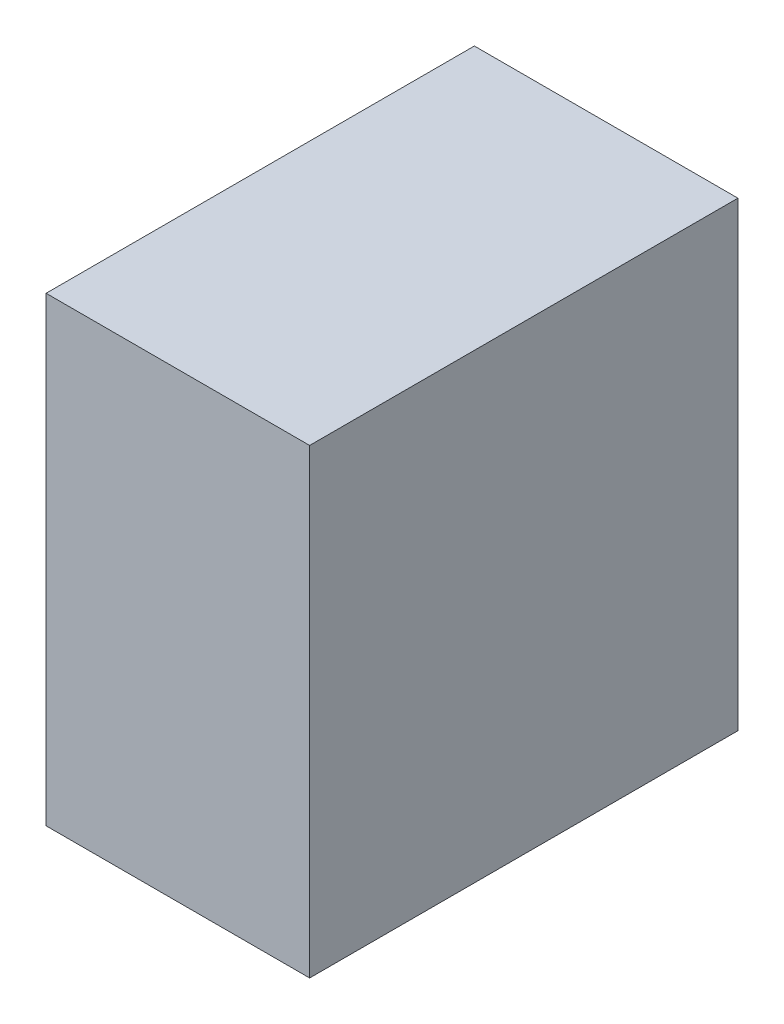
ISO-10303-21;
HEADER;
FILE_DESCRIPTION(('STEP AP214'),'2;1');
FILE_NAME('part.step','',(''),(''),'','','');
FILE_SCHEMA(('AUTOMOTIVE_DESIGN { 1 0 10303 214 1 1 1 1 }'));
ENDSEC;
DATA;
#1=APPLICATION_CONTEXT('core data for automotive mechanical design processes');
#2=APPLICATION_PROTOCOL_DEFINITION('international standard','automotive_design',2000,#1);
#3=PRODUCT_CONTEXT('',#1,'mechanical');
#4=PRODUCT('Part','Part','',(#3));
#5=PRODUCT_RELATED_PRODUCT_CATEGORY('part','',(#4));
#6=PRODUCT_DEFINITION_FORMATION('','',#4);
#7=PRODUCT_DEFINITION_CONTEXT('part definition',#1,'design');
#8=PRODUCT_DEFINITION('design','',#6,#7);
#9=PRODUCT_DEFINITION_SHAPE('','',#8);
#10=(LENGTH_UNIT() NAMED_UNIT(*) SI_UNIT(.MILLI.,.METRE.));
#11=(NAMED_UNIT(*) PLANE_ANGLE_UNIT() SI_UNIT($,.RADIAN.));
#12=(NAMED_UNIT(*) SI_UNIT($,.STERADIAN.) SOLID_ANGLE_UNIT());
#13=UNCERTAINTY_MEASURE_WITH_UNIT(LENGTH_MEASURE(1.E-05),#10,'distance_accuracy_value','');
#14=(GEOMETRIC_REPRESENTATION_CONTEXT(3) GLOBAL_UNCERTAINTY_ASSIGNED_CONTEXT((#13)) GLOBAL_UNIT_ASSIGNED_CONTEXT((#10,
#11,#12)) REPRESENTATION_CONTEXT('',''));
#15=CARTESIAN_POINT('',(0.,0.,0.));
#16=DIRECTION('',(0.,0.,1.));
#17=DIRECTION('',(1.,0.,0.));
#18=AXIS2_PLACEMENT_3D('',#15,#16,#17);
#19=CARTESIAN_POINT('',(-38.4705249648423,26.297870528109,13.));
#20=DIRECTION('',(1.,0.,0.));
#21=DIRECTION('',(0.,1.,0.));
#22=AXIS2_PLACEMENT_3D('',#19,#20,#21);
#23=PLANE('',#22);
#24=DIRECTION('',(0.,-1.,0.));
#25=VECTOR('',#24,1.);
#26=CARTESIAN_POINT('',(-38.4705249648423,26.297870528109,0.));
#27=LINE('',#26,#25);
#28=CARTESIAN_POINT('',(-38.4705249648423,26.297870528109,0.));
#29=VERTEX_POINT('',#28);
#30=CARTESIAN_POINT('',(-38.4705249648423,12.297870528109,0.));
#31=VERTEX_POINT('',#30);
#32=EDGE_CURVE('E96',#29,#31,#27,.T.);
#33=ORIENTED_EDGE('',*,*,#32,.T.);
#34=DIRECTION('',(0.,0.,-1.));
#35=VECTOR('',#34,1.);
#36=CARTESIAN_POINT('',(-38.4705249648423,12.297870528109,13.));
#37=LINE('',#36,#35);
#38=CARTESIAN_POINT('',(-38.4705249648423,12.297870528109,13.));
#39=VERTEX_POINT('',#38);
#40=EDGE_CURVE('E11',#39,#31,#37,.T.);
#41=ORIENTED_EDGE('',*,*,#40,.F.);
#42=DIRECTION('',(0.,-1.,0.));
#43=VECTOR('',#42,1.);
#44=CARTESIAN_POINT('',(-38.4705249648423,26.297870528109,13.));
#45=LINE('',#44,#43);
#46=CARTESIAN_POINT('',(-38.4705249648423,26.297870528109,13.));
#47=VERTEX_POINT('',#46);
#48=EDGE_CURVE('E84',#47,#39,#45,.T.);
#49=ORIENTED_EDGE('',*,*,#48,.F.);
#50=DIRECTION('',(0.,0.,-1.));
#51=VECTOR('',#50,1.);
#52=CARTESIAN_POINT('',(-38.4705249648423,26.297870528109,13.));
#53=LINE('',#52,#51);
#54=EDGE_CURVE('E92',#47,#29,#53,.T.);
#55=ORIENTED_EDGE('',*,*,#54,.T.);
#56=EDGE_LOOP('',(#33,#41,#49,#55));
#57=FACE_BOUND('',#56,.T.);
#58=ADVANCED_FACE('F33',(#57),#23,.F.);
#59=CARTESIAN_POINT('',(-38.4705249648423,12.297870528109,13.));
#60=DIRECTION('',(0.,1.,0.));
#61=DIRECTION('',(0.,0.,1.));
#62=AXIS2_PLACEMENT_3D('',#59,#60,#61);
#63=PLANE('',#62);
#64=DIRECTION('',(1.,0.,0.));
#65=VECTOR('',#64,1.);
#66=CARTESIAN_POINT('',(-38.4705249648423,12.297870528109,0.));
#67=LINE('',#66,#65);
#68=CARTESIAN_POINT('',(-30.4705249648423,12.297870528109,0.));
#69=VERTEX_POINT('',#68);
#70=EDGE_CURVE('E88',#31,#69,#67,.T.);
#71=ORIENTED_EDGE('',*,*,#70,.T.);
#72=DIRECTION('',(0.,0.,-1.));
#73=VECTOR('',#72,1.);
#74=CARTESIAN_POINT('',(-30.4705249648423,12.297870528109,13.));
#75=LINE('',#74,#73);
#76=CARTESIAN_POINT('',(-30.4705249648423,12.297870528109,13.));
#77=VERTEX_POINT('',#76);
#78=EDGE_CURVE('E41',#77,#69,#75,.T.);
#79=ORIENTED_EDGE('',*,*,#78,.F.);
#80=DIRECTION('',(1.,0.,0.));
#81=VECTOR('',#80,1.);
#82=CARTESIAN_POINT('',(-38.4705249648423,12.297870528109,13.));
#83=LINE('',#82,#81);
#84=EDGE_CURVE('E79',#39,#77,#83,.T.);
#85=ORIENTED_EDGE('',*,*,#84,.F.);
#86=ORIENTED_EDGE('',*,*,#40,.T.);
#87=EDGE_LOOP('',(#71,#79,#85,#86));
#88=FACE_BOUND('',#87,.T.);
#89=ADVANCED_FACE('F87',(#88),#63,.F.);
#90=CARTESIAN_POINT('',(-30.4705249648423,26.297870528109,13.));
#91=DIRECTION('',(-1.,0.,0.));
#92=DIRECTION('',(0.,-1.,0.));
#93=AXIS2_PLACEMENT_3D('',#90,#91,#92);
#94=PLANE('',#93);
#95=DIRECTION('',(0.,1.,0.));
#96=VECTOR('',#95,1.);
#97=CARTESIAN_POINT('',(-30.4705249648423,26.297870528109,0.));
#98=LINE('',#97,#96);
#99=CARTESIAN_POINT('',(-30.4705249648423,26.297870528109,0.));
#100=VERTEX_POINT('',#99);
#101=EDGE_CURVE('E66',#69,#100,#98,.T.);
#102=ORIENTED_EDGE('',*,*,#101,.T.);
#103=DIRECTION('',(0.,0.,-1.));
#104=VECTOR('',#103,1.);
#105=CARTESIAN_POINT('',(-30.4705249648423,26.297870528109,13.));
#106=LINE('',#105,#104);
#107=CARTESIAN_POINT('',(-30.4705249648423,26.297870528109,13.));
#108=VERTEX_POINT('',#107);
#109=EDGE_CURVE('E89',#108,#100,#106,.T.);
#110=ORIENTED_EDGE('',*,*,#109,.F.);
#111=DIRECTION('',(0.,1.,0.));
#112=VECTOR('',#111,1.);
#113=CARTESIAN_POINT('',(-30.4705249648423,26.297870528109,13.));
#114=LINE('',#113,#112);
#115=EDGE_CURVE('E82',#77,#108,#114,.T.);
#116=ORIENTED_EDGE('',*,*,#115,.F.);
#117=ORIENTED_EDGE('',*,*,#78,.T.);
#118=EDGE_LOOP('',(#102,#110,#116,#117));
#119=FACE_BOUND('',#118,.T.);
#120=ADVANCED_FACE('F90',(#119),#94,.F.);
#121=CARTESIAN_POINT('',(-38.4705249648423,26.297870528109,13.));
#122=DIRECTION('',(0.,-1.,0.));
#123=DIRECTION('',(0.,0.,-1.));
#124=AXIS2_PLACEMENT_3D('',#121,#122,#123);
#125=PLANE('',#124);
#126=DIRECTION('',(-1.,0.,0.));
#127=VECTOR('',#126,1.);
#128=CARTESIAN_POINT('',(-38.4705249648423,26.297870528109,0.));
#129=LINE('',#128,#127);
#130=EDGE_CURVE('E72',#100,#29,#129,.T.);
#131=ORIENTED_EDGE('',*,*,#130,.T.);
#132=ORIENTED_EDGE('',*,*,#54,.F.);
#133=DIRECTION('',(-1.,0.,0.));
#134=VECTOR('',#133,1.);
#135=CARTESIAN_POINT('',(-38.4705249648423,26.297870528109,13.));
#136=LINE('',#135,#134);
#137=EDGE_CURVE('E49',#108,#47,#136,.T.);
#138=ORIENTED_EDGE('',*,*,#137,.F.);
#139=ORIENTED_EDGE('',*,*,#109,.T.);
#140=EDGE_LOOP('',(#131,#132,#138,#139));
#141=FACE_BOUND('',#140,.T.);
#142=ADVANCED_FACE('F103',(#141),#125,.F.);
#143=CARTESIAN_POINT('',(0.,0.,13.));
#144=DIRECTION('',(0.,0.,1.));
#145=DIRECTION('',(1.,0.,0.));
#146=AXIS2_PLACEMENT_3D('',#143,#144,#145);
#147=PLANE('',#146);
#148=ORIENTED_EDGE('',*,*,#48,.T.);
#149=ORIENTED_EDGE('',*,*,#84,.T.);
#150=ORIENTED_EDGE('',*,*,#115,.T.);
#151=ORIENTED_EDGE('',*,*,#137,.T.);
#152=EDGE_LOOP('',(#148,#149,#150,#151));
#153=FACE_BOUND('',#152,.T.);
#154=ADVANCED_FACE('F80',(#153),#147,.T.);
#155=CARTESIAN_POINT('',(0.,0.,0.));
#156=DIRECTION('',(0.,0.,1.));
#157=DIRECTION('',(1.,0.,0.));
#158=AXIS2_PLACEMENT_3D('',#155,#156,#157);
#159=PLANE('',#158);
#160=ORIENTED_EDGE('',*,*,#32,.F.);
#161=ORIENTED_EDGE('',*,*,#130,.F.);
#162=ORIENTED_EDGE('',*,*,#101,.F.);
#163=ORIENTED_EDGE('',*,*,#70,.F.);
#164=EDGE_LOOP('',(#160,#161,#162,#163));
#165=FACE_BOUND('',#164,.T.);
#166=ADVANCED_FACE('F106',(#165),#159,.F.);
#167=CLOSED_SHELL('',(#58,#89,#120,#142,#154,#166));
#168=MANIFOLD_SOLID_BREP('B2',#167);
#169=ADVANCED_BREP_SHAPE_REPRESENTATION('',(#18,#168),#14);
#170=SHAPE_DEFINITION_REPRESENTATION(#9,#169);
ENDSEC;
END-ISO-10303-21;
